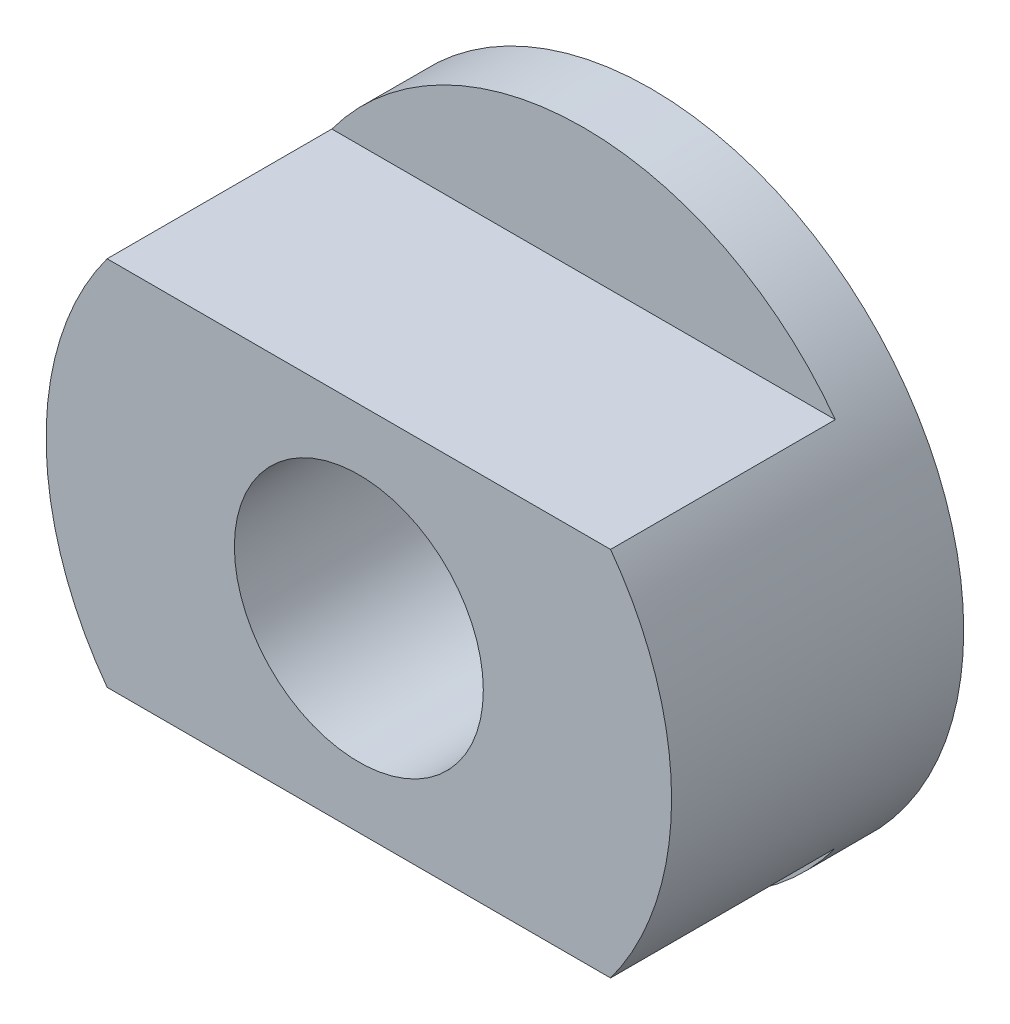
ISO-10303-21;
HEADER;
FILE_DESCRIPTION(('STEP AP214'),'2;1');
FILE_NAME('part.step','',(''),(''),'','','');
FILE_SCHEMA(('AUTOMOTIVE_DESIGN { 1 0 10303 214 1 1 1 1 }'));
ENDSEC;
DATA;
#1=APPLICATION_CONTEXT('core data for automotive mechanical design processes');
#2=APPLICATION_PROTOCOL_DEFINITION('international standard','automotive_design',2000,#1);
#3=PRODUCT_CONTEXT('',#1,'mechanical');
#4=PRODUCT('Part','Part','',(#3));
#5=PRODUCT_RELATED_PRODUCT_CATEGORY('part','',(#4));
#6=PRODUCT_DEFINITION_FORMATION('','',#4);
#7=PRODUCT_DEFINITION_CONTEXT('part definition',#1,'design');
#8=PRODUCT_DEFINITION('design','',#6,#7);
#9=PRODUCT_DEFINITION_SHAPE('','',#8);
#10=(LENGTH_UNIT() NAMED_UNIT(*) SI_UNIT(.MILLI.,.METRE.));
#11=(NAMED_UNIT(*) PLANE_ANGLE_UNIT() SI_UNIT($,.RADIAN.));
#12=(NAMED_UNIT(*) SI_UNIT($,.STERADIAN.) SOLID_ANGLE_UNIT());
#13=UNCERTAINTY_MEASURE_WITH_UNIT(LENGTH_MEASURE(1.E-05),#10,'distance_accuracy_value','');
#14=(GEOMETRIC_REPRESENTATION_CONTEXT(3) GLOBAL_UNCERTAINTY_ASSIGNED_CONTEXT((#13)) GLOBAL_UNIT_ASSIGNED_CONTEXT((#10,
#11,#12)) REPRESENTATION_CONTEXT('',''));
#15=CARTESIAN_POINT('',(0.,0.,0.));
#16=DIRECTION('',(0.,0.,1.));
#17=DIRECTION('',(1.,0.,0.));
#18=AXIS2_PLACEMENT_3D('',#15,#16,#17);
#19=CARTESIAN_POINT('',(0.,0.,7.8));
#20=DIRECTION('',(0.,0.,-1.));
#21=DIRECTION('',(-1.,0.,0.));
#22=AXIS2_PLACEMENT_3D('',#19,#20,#21);
#23=CYLINDRICAL_SURFACE('',#22,3.3235);
#24=CARTESIAN_POINT('',(0.,0.,7.8));
#25=DIRECTION('',(0.,0.,-1.));
#26=DIRECTION('',(-1.,0.,0.));
#27=AXIS2_PLACEMENT_3D('',#24,#25,#26);
#28=CIRCLE('',#27,3.3235);
#29=CARTESIAN_POINT('',(3.3235,0.,7.8));
#30=VERTEX_POINT('',#29);
#31=EDGE_CURVE('E20',#30,#30,#28,.F.);
#32=ORIENTED_EDGE('',*,*,#31,.T.);
#33=EDGE_LOOP('',(#32));
#34=FACE_BOUND('',#33,.T.);
#35=CARTESIAN_POINT('',(0.,0.,0.));
#36=DIRECTION('',(0.,0.,-1.));
#37=DIRECTION('',(-1.,0.,0.));
#38=AXIS2_PLACEMENT_3D('',#35,#36,#37);
#39=CIRCLE('',#38,3.3235);
#40=CARTESIAN_POINT('',(-3.3235,0.,0.));
#41=VERTEX_POINT('',#40);
#42=EDGE_CURVE('E35',#41,#41,#39,.F.);
#43=ORIENTED_EDGE('',*,*,#42,.F.);
#44=EDGE_LOOP('',(#43));
#45=FACE_BOUND('',#44,.T.);
#46=ADVANCED_FACE('F16',(#34,#45),#23,.F.);
#47=CARTESIAN_POINT('',(0.,11.8069254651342,1.8));
#48=DIRECTION('',(0.,0.,-1.));
#49=DIRECTION('',(-1.,0.,0.));
#50=AXIS2_PLACEMENT_3D('',#47,#48,#49);
#51=PLANE('',#50);
#52=DIRECTION('',(1.,0.,0.));
#53=VECTOR('',#52,1.);
#54=CARTESIAN_POINT('',(0.,4.955,1.8));
#55=LINE('',#54,#53);
#56=CARTESIAN_POINT('',(-6.72089837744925,4.955,1.8));
#57=VERTEX_POINT('',#56);
#58=CARTESIAN_POINT('',(6.72089837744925,4.955,1.8));
#59=VERTEX_POINT('',#58);
#60=EDGE_CURVE('E92',#57,#59,#55,.T.);
#61=ORIENTED_EDGE('',*,*,#60,.T.);
#62=CARTESIAN_POINT('',(0.,0.,1.8));
#63=DIRECTION('',(0.,0.,1.));
#64=DIRECTION('',(1.,0.,0.));
#65=AXIS2_PLACEMENT_3D('',#62,#63,#64);
#66=CIRCLE('',#65,8.35);
#67=EDGE_CURVE('E94',#57,#59,#66,.F.);
#68=ORIENTED_EDGE('',*,*,#67,.F.);
#69=EDGE_LOOP('',(#61,#68));
#70=FACE_BOUND('',#69,.T.);
#71=ADVANCED_FACE('F121',(#70),#51,.F.);
#72=CARTESIAN_POINT('',(0.,4.955,1.8));
#73=DIRECTION('',(0.,-1.,0.));
#74=DIRECTION('',(0.,0.,-1.));
#75=AXIS2_PLACEMENT_3D('',#72,#73,#74);
#76=PLANE('',#75);
#77=DIRECTION('',(-1.,0.,0.));
#78=VECTOR('',#77,1.);
#79=CARTESIAN_POINT('',(0.,4.955,7.8));
#80=LINE('',#79,#78);
#81=CARTESIAN_POINT('',(-6.72089837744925,4.955,7.8));
#82=VERTEX_POINT('',#81);
#83=CARTESIAN_POINT('',(6.72089837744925,4.955,7.8));
#84=VERTEX_POINT('',#83);
#85=EDGE_CURVE('E90',#82,#84,#80,.F.);
#86=ORIENTED_EDGE('',*,*,#85,.T.);
#87=DIRECTION('',(0.,0.,1.));
#88=VECTOR('',#87,1.);
#89=CARTESIAN_POINT('',(6.72089837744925,4.955,0.));
#90=LINE('',#89,#88);
#91=EDGE_CURVE('E84',#59,#84,#90,.T.);
#92=ORIENTED_EDGE('',*,*,#91,.F.);
#93=ORIENTED_EDGE('',*,*,#60,.F.);
#94=DIRECTION('',(0.,0.,1.));
#95=VECTOR('',#94,1.);
#96=CARTESIAN_POINT('',(-6.72089837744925,4.955,0.));
#97=LINE('',#96,#95);
#98=EDGE_CURVE('E96',#82,#57,#97,.F.);
#99=ORIENTED_EDGE('',*,*,#98,.F.);
#100=EDGE_LOOP('',(#86,#92,#93,#99));
#101=FACE_BOUND('',#100,.T.);
#102=ADVANCED_FACE('F117',(#101),#76,.F.);
#103=CARTESIAN_POINT('',(0.,0.,7.8));
#104=DIRECTION('',(0.,0.,-1.));
#105=DIRECTION('',(-1.,0.,0.));
#106=AXIS2_PLACEMENT_3D('',#103,#104,#105);
#107=PLANE('',#106);
#108=ORIENTED_EDGE('',*,*,#31,.F.);
#109=EDGE_LOOP('',(#108));
#110=FACE_BOUND('',#109,.T.);
#111=CARTESIAN_POINT('',(0.,0.,7.8));
#112=DIRECTION('',(0.,0.,1.));
#113=DIRECTION('',(1.,0.,0.));
#114=AXIS2_PLACEMENT_3D('',#111,#112,#113);
#115=CIRCLE('',#114,8.35);
#116=CARTESIAN_POINT('',(6.72089837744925,-4.955,7.8));
#117=VERTEX_POINT('',#116);
#118=EDGE_CURVE('E82',#84,#117,#115,.F.);
#119=ORIENTED_EDGE('',*,*,#118,.F.);
#120=ORIENTED_EDGE('',*,*,#85,.F.);
#121=CARTESIAN_POINT('',(0.,0.,7.8));
#122=DIRECTION('',(0.,0.,1.));
#123=DIRECTION('',(1.,0.,0.));
#124=AXIS2_PLACEMENT_3D('',#121,#122,#123);
#125=CIRCLE('',#124,8.35);
#126=CARTESIAN_POINT('',(-6.72089837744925,-4.955,7.8));
#127=VERTEX_POINT('',#126);
#128=EDGE_CURVE('E88',#127,#82,#125,.F.);
#129=ORIENTED_EDGE('',*,*,#128,.F.);
#130=DIRECTION('',(1.,0.,0.));
#131=VECTOR('',#130,1.);
#132=CARTESIAN_POINT('',(0.,-4.955,7.8));
#133=LINE('',#132,#131);
#134=EDGE_CURVE('E75',#127,#117,#133,.T.);
#135=ORIENTED_EDGE('',*,*,#134,.T.);
#136=EDGE_LOOP('',(#119,#120,#129,#135));
#137=FACE_BOUND('',#136,.T.);
#138=ADVANCED_FACE('F114',(#110,#137),#107,.F.);
#139=CARTESIAN_POINT('',(6.72089837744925,-4.955,7.8));
#140=DIRECTION('',(0.,1.,0.));
#141=DIRECTION('',(0.,0.,-1.));
#142=AXIS2_PLACEMENT_3D('',#139,#140,#141);
#143=PLANE('',#142);
#144=DIRECTION('',(1.,0.,0.));
#145=VECTOR('',#144,1.);
#146=CARTESIAN_POINT('',(0.,-4.955,1.8));
#147=LINE('',#146,#145);
#148=CARTESIAN_POINT('',(-6.72089837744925,-4.955,1.8));
#149=VERTEX_POINT('',#148);
#150=CARTESIAN_POINT('',(6.72089837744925,-4.955,1.8));
#151=VERTEX_POINT('',#150);
#152=EDGE_CURVE('E65',#149,#151,#147,.T.);
#153=ORIENTED_EDGE('',*,*,#152,.T.);
#154=DIRECTION('',(0.,0.,1.));
#155=VECTOR('',#154,1.);
#156=CARTESIAN_POINT('',(6.72089837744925,-4.955,0.));
#157=LINE('',#156,#155);
#158=EDGE_CURVE('E69',#117,#151,#157,.F.);
#159=ORIENTED_EDGE('',*,*,#158,.F.);
#160=ORIENTED_EDGE('',*,*,#134,.F.);
#161=DIRECTION('',(0.,0.,1.));
#162=VECTOR('',#161,1.);
#163=CARTESIAN_POINT('',(-6.72089837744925,-4.955,0.));
#164=LINE('',#163,#162);
#165=EDGE_CURVE('E72',#149,#127,#164,.T.);
#166=ORIENTED_EDGE('',*,*,#165,.F.);
#167=EDGE_LOOP('',(#153,#159,#160,#166));
#168=FACE_BOUND('',#167,.T.);
#169=ADVANCED_FACE('F67',(#168),#143,.F.);
#170=CARTESIAN_POINT('',(6.72089837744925,-8.38395,1.8));
#171=DIRECTION('',(0.,0.,-1.));
#172=DIRECTION('',(-1.,0.,0.));
#173=AXIS2_PLACEMENT_3D('',#170,#171,#172);
#174=PLANE('',#173);
#175=ORIENTED_EDGE('',*,*,#152,.F.);
#176=CARTESIAN_POINT('',(0.,0.,1.8));
#177=DIRECTION('',(0.,0.,1.));
#178=DIRECTION('',(1.,0.,0.));
#179=AXIS2_PLACEMENT_3D('',#176,#177,#178);
#180=CIRCLE('',#179,8.35);
#181=EDGE_CURVE('E25',#151,#149,#180,.F.);
#182=ORIENTED_EDGE('',*,*,#181,.F.);
#183=EDGE_LOOP('',(#175,#182));
#184=FACE_BOUND('',#183,.T.);
#185=ADVANCED_FACE('F18',(#184),#174,.F.);
#186=CARTESIAN_POINT('',(0.,0.,0.));
#187=DIRECTION('',(0.,0.,-1.));
#188=DIRECTION('',(-1.,0.,0.));
#189=AXIS2_PLACEMENT_3D('',#186,#187,#188);
#190=PLANE('',#189);
#191=ORIENTED_EDGE('',*,*,#42,.T.);
#192=EDGE_LOOP('',(#191));
#193=FACE_BOUND('',#192,.T.);
#194=CARTESIAN_POINT('',(0.,0.,0.));
#195=DIRECTION('',(0.,0.,1.));
#196=DIRECTION('',(1.,0.,0.));
#197=AXIS2_PLACEMENT_3D('',#194,#195,#196);
#198=CIRCLE('',#197,8.35);
#199=CARTESIAN_POINT('',(8.35,0.,0.));
#200=VERTEX_POINT('',#199);
#201=EDGE_CURVE('E11',#200,#200,#198,.T.);
#202=ORIENTED_EDGE('',*,*,#201,.F.);
#203=EDGE_LOOP('',(#202));
#204=FACE_BOUND('',#203,.T.);
#205=ADVANCED_FACE('F103',(#193,#204),#190,.T.);
#206=CARTESIAN_POINT('',(0.,0.,0.));
#207=DIRECTION('',(0.,0.,1.));
#208=DIRECTION('',(1.,0.,0.));
#209=AXIS2_PLACEMENT_3D('',#206,#207,#208);
#210=CYLINDRICAL_SURFACE('',#209,8.35);
#211=ORIENTED_EDGE('',*,*,#201,.T.);
#212=EDGE_LOOP('',(#211));
#213=FACE_BOUND('',#212,.T.);
#214=ORIENTED_EDGE('',*,*,#158,.T.);
#215=ORIENTED_EDGE('',*,*,#181,.T.);
#216=ORIENTED_EDGE('',*,*,#165,.T.);
#217=ORIENTED_EDGE('',*,*,#128,.T.);
#218=ORIENTED_EDGE('',*,*,#98,.T.);
#219=ORIENTED_EDGE('',*,*,#67,.T.);
#220=ORIENTED_EDGE('',*,*,#91,.T.);
#221=ORIENTED_EDGE('',*,*,#118,.T.);
#222=EDGE_LOOP('',(#214,#215,#216,#217,#218,#219,#220,#221));
#223=FACE_BOUND('',#222,.T.);
#224=ADVANCED_FACE('F79',(#213,#223),#210,.T.);
#225=CLOSED_SHELL('',(#46,#71,#102,#138,#169,#185,#205,#224));
#226=MANIFOLD_SOLID_BREP('B1',#225);
#227=ADVANCED_BREP_SHAPE_REPRESENTATION('',(#18,#226),#14);
#228=SHAPE_DEFINITION_REPRESENTATION(#9,#227);
ENDSEC;
END-ISO-10303-21;
